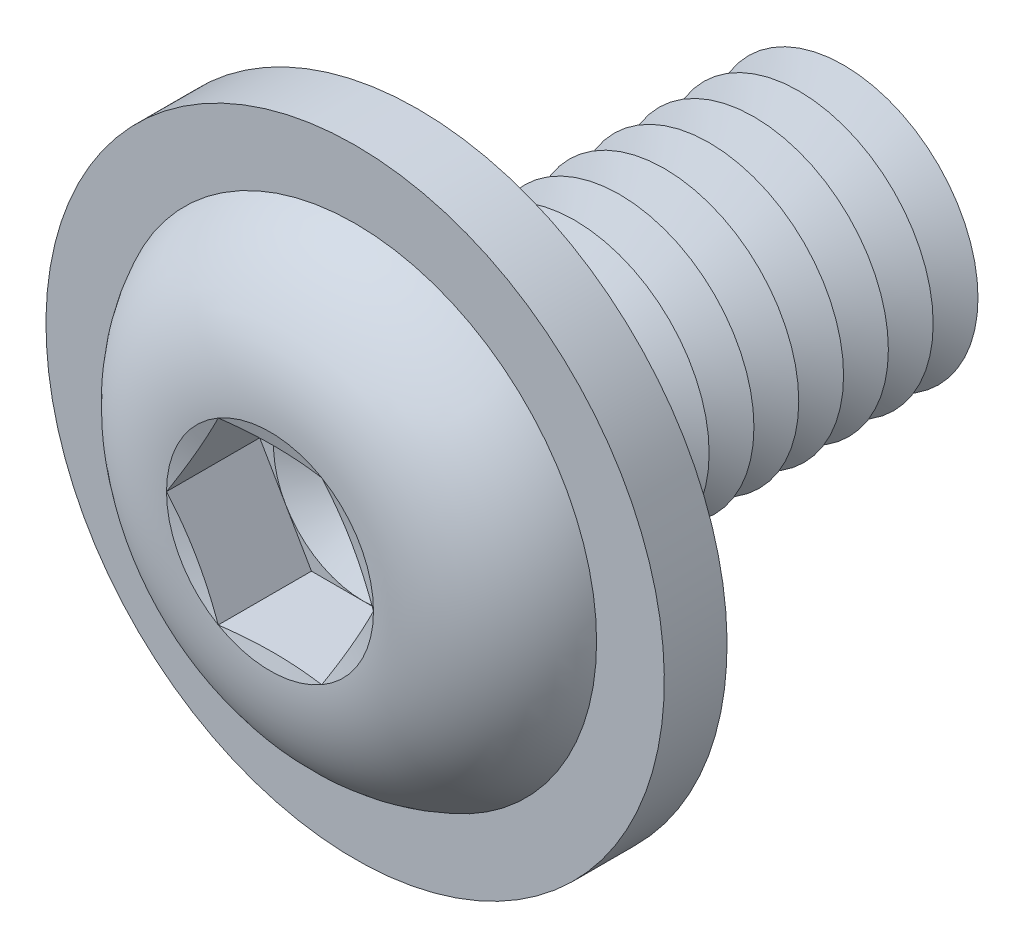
from build123d import *

# Parameters (mm, degrees)
FILLET1_R           = 0.25
LPATTERN1_COUNT     = 10
LPATTERN1_PITCH     = 0.5
CUT_EXTRUDE1_DEPTH  = 1.04
SKETCH5_R           = 3.45
SKETCH5_R_2         = 1.75
BOSS_EXTRUDE1_DEPTH = 0.7


with BuildPart() as part:
    # Sketch1 → Revolve1 (revolve)
    with BuildSketch(Plane(origin=(0, 0, 0), x_dir=(0, 0, -1), z_dir=(1, 0, 0)), mode=Mode.PRIVATE) as revolve1_sk:
        with BuildLine():
            Line((0, 1.5), (0, 2.85))
            ThreePointArc((0, 2.85), (-1.182850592, 2.35063849), (-1.65, 1.1547))
            Line((-1.65, 1.1547), (-1.495299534, 0.57735))
            Line((-1.495299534, 0.57735), (-1.65, 0.57735))
            Line((-1.65, 0.57735), (-1.65, 0))
            Line((-1.65, 0), (5, 0))
            Line((5, 0), (5, 1.5))
            Line((5, 1.5), (0, 1.5))
        make_face()
    revolve(revolve1_sk.sketch.rotate(Axis((0, 0, -5), (0, 0, 1)), 90), axis=Axis((0, 0, -5), (0, 0, 1)))

    # Fillet1
    fillet1_edges = [part.edges().sort_by_distance(p)[0] for p in [
        (1.5, 0, 0),
    ]]
    fillet(fillet1_edges, radius=FILLET1_R)

    # Sketch2 → Cut-Revolve1 (revolve, cut)
    with BuildSketch(Plane(origin=(0, 0, 0), x_dir=(0, 0, -1), z_dir=(1, 0, 0)), mode=Mode.PRIVATE) as cut_revolve1_sk:
        Polygon((4.75, 1.5), (5.25, 1.5), (5, 1.066987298), align=None)
    cut_revolve1 = revolve(cut_revolve1_sk.sketch.rotate(Axis((0, 0, -5), (0, 0, -1)), 270), axis=Axis((0, 0, -5), (0, 0, -1)), mode=Mode.SUBTRACT)

    # LPattern1: Cut-Revolve1 ×10
    with Locations(*[(0, 0, i * LPATTERN1_PITCH) for i in range(1, LPATTERN1_COUNT)]):
        add(cut_revolve1, mode=Mode.SUBTRACT)

    # Sketch3 → Cut-Extrude1 (cut)
    with BuildSketch(Plane.XY.offset(1.65)):
        Polygon((0.57735, 0.999999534), (-0.57735, 0.999999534), (-1.1547, 0), (-0.57735, -0.999999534), (0.57735, -0.999999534), (1.1547, 0), align=None)
    extrude(amount=-CUT_EXTRUDE1_DEPTH, mode=Mode.SUBTRACT)

    # Cut-Extrude2 cone 1 section (on through the dimple's axis) → Cut-Extrude2 (revolve, cut)
    with BuildSketch(Plane(origin=(0, 0, 0.61), x_dir=(0, -1, 0), z_dir=(1, 0, 0))):
        Polygon((0, 0), (0.999999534, 0), (0, 0.57735), align=None)
    revolve(axis=Axis((0, 0, 0.61), (0, 0, -1)), mode=Mode.SUBTRACT)

    # Sketch5 → Boss-Extrude1 (add)
    with BuildSketch(Plane(origin=(0, 0, 0), x_dir=(-1, 0, 0), z_dir=(0, 0, -1))):
        with Locations(Location((0, 0, 0), (0, 0, 90))):
            Circle(SKETCH5_R)
        Circle(SKETCH5_R_2, mode=Mode.SUBTRACT)
    extrude(amount=-BOSS_EXTRUDE1_DEPTH)


solid = part.part
